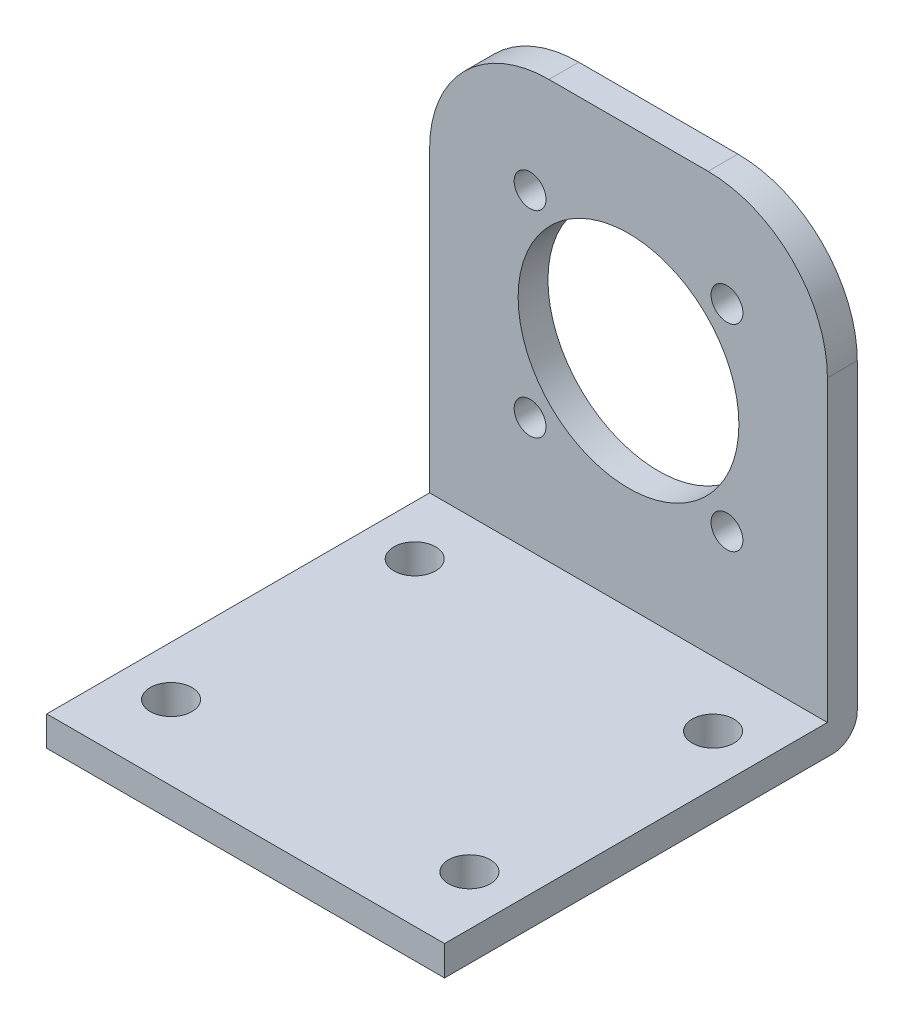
ISO-10303-21;
HEADER;
FILE_DESCRIPTION(('STEP AP214'),'2;1');
FILE_NAME('part.step','',(''),(''),'','','');
FILE_SCHEMA(('AUTOMOTIVE_DESIGN { 1 0 10303 214 1 1 1 1 }'));
ENDSEC;
DATA;
#1=APPLICATION_CONTEXT('core data for automotive mechanical design processes');
#2=APPLICATION_PROTOCOL_DEFINITION('international standard','automotive_design',2000,#1);
#3=PRODUCT_CONTEXT('',#1,'mechanical');
#4=PRODUCT('Part','Part','',(#3));
#5=PRODUCT_RELATED_PRODUCT_CATEGORY('part','',(#4));
#6=PRODUCT_DEFINITION_FORMATION('','',#4);
#7=PRODUCT_DEFINITION_CONTEXT('part definition',#1,'design');
#8=PRODUCT_DEFINITION('design','',#6,#7);
#9=PRODUCT_DEFINITION_SHAPE('','',#8);
#10=(LENGTH_UNIT() NAMED_UNIT(*) SI_UNIT(.MILLI.,.METRE.));
#11=(NAMED_UNIT(*) PLANE_ANGLE_UNIT() SI_UNIT($,.RADIAN.));
#12=(NAMED_UNIT(*) SI_UNIT($,.STERADIAN.) SOLID_ANGLE_UNIT());
#13=UNCERTAINTY_MEASURE_WITH_UNIT(LENGTH_MEASURE(1.E-05),#10,'distance_accuracy_value','');
#14=(GEOMETRIC_REPRESENTATION_CONTEXT(3) GLOBAL_UNCERTAINTY_ASSIGNED_CONTEXT((#13)) GLOBAL_UNIT_ASSIGNED_CONTEXT((#10,
#11,#12)) REPRESENTATION_CONTEXT('',''));
#15=CARTESIAN_POINT('',(0.,0.,0.));
#16=DIRECTION('',(0.,0.,1.));
#17=DIRECTION('',(1.,0.,0.));
#18=AXIS2_PLACEMENT_3D('',#15,#16,#17);
#19=CARTESIAN_POINT('',(-40.,33.419460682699,-26.1464462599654));
#20=DIRECTION('',(0.,1.,0.));
#21=DIRECTION('',(0.,0.,1.));
#22=AXIS2_PLACEMENT_3D('',#19,#20,#21);
#23=PLANE('',#22);
#24=DIRECTION('',(1.,0.,0.));
#25=VECTOR('',#24,1.);
#26=CARTESIAN_POINT('',(-40.,33.419460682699,-23.1464462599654));
#27=LINE('',#26,#25);
#28=CARTESIAN_POINT('',(-27.9999999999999,33.419460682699,-23.1464462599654));
#29=VERTEX_POINT('',#28);
#30=CARTESIAN_POINT('',(-12.0000000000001,33.419460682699,-23.1464462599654));
#31=VERTEX_POINT('',#30);
#32=EDGE_CURVE('E152',#29,#31,#27,.T.);
#33=ORIENTED_EDGE('',*,*,#32,.T.);
#34=DIRECTION('',(0.,0.,1.));
#35=VECTOR('',#34,1.);
#36=CARTESIAN_POINT('',(-12.0000000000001,33.419460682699,-63.1464462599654));
#37=LINE('',#36,#35);
#38=CARTESIAN_POINT('',(-12.0000000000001,33.419460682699,-26.1464462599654));
#39=VERTEX_POINT('',#38);
#40=EDGE_CURVE('E137',#39,#31,#37,.T.);
#41=ORIENTED_EDGE('',*,*,#40,.F.);
#42=DIRECTION('',(1.,0.,0.));
#43=VECTOR('',#42,1.);
#44=CARTESIAN_POINT('',(-40.,33.419460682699,-26.1464462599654));
#45=LINE('',#44,#43);
#46=CARTESIAN_POINT('',(-27.9999999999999,33.419460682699,-26.1464462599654));
#47=VERTEX_POINT('',#46);
#48=EDGE_CURVE('E173',#47,#39,#45,.T.);
#49=ORIENTED_EDGE('',*,*,#48,.F.);
#50=DIRECTION('',(0.,0.,1.));
#51=VECTOR('',#50,1.);
#52=CARTESIAN_POINT('',(-27.9999999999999,33.419460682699,-63.1464462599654));
#53=LINE('',#52,#51);
#54=EDGE_CURVE('E159',#47,#29,#53,.T.);
#55=ORIENTED_EDGE('',*,*,#54,.T.);
#56=EDGE_LOOP('',(#33,#41,#49,#55));
#57=FACE_BOUND('',#56,.T.);
#58=ADVANCED_FACE('F69',(#57),#23,.T.);
#59=CARTESIAN_POINT('',(-40.,-9.08053931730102,-26.1464462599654));
#60=DIRECTION('',(0.,0.,-1.));
#61=DIRECTION('',(-1.,0.,0.));
#62=AXIS2_PLACEMENT_3D('',#59,#60,#61);
#63=PLANE('',#62);
#64=CARTESIAN_POINT('',(-29.8994949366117,22.8189556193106,-26.1464462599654));
#65=DIRECTION('',(0.,0.,-1.));
#66=DIRECTION('',(-1.,0.,0.));
#67=AXIS2_PLACEMENT_3D('',#64,#65,#66);
#68=CIRCLE('',#67,1.6);
#69=CARTESIAN_POINT('',(-31.4994949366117,22.8189556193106,-26.1464462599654));
#70=VERTEX_POINT('',#69);
#71=EDGE_CURVE('E216',#70,#70,#68,.T.);
#72=ORIENTED_EDGE('',*,*,#71,.F.);
#73=EDGE_LOOP('',(#72));
#74=FACE_BOUND('',#73,.T.);
#75=CARTESIAN_POINT('',(-10.1005050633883,22.8189556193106,-26.1464462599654));
#76=DIRECTION('',(0.,0.,-1.));
#77=DIRECTION('',(-1.,0.,0.));
#78=AXIS2_PLACEMENT_3D('',#75,#76,#77);
#79=CIRCLE('',#78,1.6);
#80=CARTESIAN_POINT('',(-11.7005050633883,22.8189556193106,-26.1464462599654));
#81=VERTEX_POINT('',#80);
#82=EDGE_CURVE('E291',#81,#81,#79,.T.);
#83=ORIENTED_EDGE('',*,*,#82,.F.);
#84=EDGE_LOOP('',(#83));
#85=FACE_BOUND('',#84,.T.);
#86=CARTESIAN_POINT('',(-10.1005050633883,3.01996574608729,-26.1464462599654));
#87=DIRECTION('',(0.,0.,-1.));
#88=DIRECTION('',(-1.,0.,0.));
#89=AXIS2_PLACEMENT_3D('',#86,#87,#88);
#90=CIRCLE('',#89,1.6);
#91=CARTESIAN_POINT('',(-11.7005050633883,3.01996574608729,-26.1464462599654));
#92=VERTEX_POINT('',#91);
#93=EDGE_CURVE('E288',#92,#92,#90,.T.);
#94=ORIENTED_EDGE('',*,*,#93,.F.);
#95=EDGE_LOOP('',(#94));
#96=FACE_BOUND('',#95,.T.);
#97=CARTESIAN_POINT('',(-29.8994949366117,3.01996574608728,-26.1464462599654));
#98=DIRECTION('',(0.,0.,-1.));
#99=DIRECTION('',(-1.,0.,0.));
#100=AXIS2_PLACEMENT_3D('',#97,#98,#99);
#101=CIRCLE('',#100,1.6);
#102=CARTESIAN_POINT('',(-31.4994949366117,3.01996574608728,-26.1464462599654));
#103=VERTEX_POINT('',#102);
#104=EDGE_CURVE('E284',#103,#103,#101,.T.);
#105=ORIENTED_EDGE('',*,*,#104,.F.);
#106=EDGE_LOOP('',(#105));
#107=FACE_BOUND('',#106,.T.);
#108=CARTESIAN_POINT('',(-20.,12.919460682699,-26.1464462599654));
#109=DIRECTION('',(0.,0.,-1.));
#110=DIRECTION('',(-1.,0.,0.));
#111=AXIS2_PLACEMENT_3D('',#108,#109,#110);
#112=CIRCLE('',#111,11.1);
#113=CARTESIAN_POINT('',(-31.1,12.919460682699,-26.1464462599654));
#114=VERTEX_POINT('',#113);
#115=EDGE_CURVE('E280',#114,#114,#112,.T.);
#116=ORIENTED_EDGE('',*,*,#115,.F.);
#117=EDGE_LOOP('',(#116));
#118=FACE_BOUND('',#117,.T.);
#119=CARTESIAN_POINT('',(-12.,21.419460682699,-26.1464462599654));
#120=DIRECTION('',(0.,0.,-1.));
#121=DIRECTION('',(-1.,0.,0.));
#122=AXIS2_PLACEMENT_3D('',#119,#120,#121);
#123=CIRCLE('',#122,12.);
#124=CARTESIAN_POINT('',(0.,21.4194606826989,-26.1464462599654));
#125=VERTEX_POINT('',#124);
#126=EDGE_CURVE('E140',#125,#39,#123,.F.);
#127=ORIENTED_EDGE('',*,*,#126,.F.);
#128=DIRECTION('',(0.,1.,0.));
#129=VECTOR('',#128,1.);
#130=CARTESIAN_POINT('',(0.,-9.08053931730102,-26.1464462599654));
#131=LINE('',#130,#129);
#132=CARTESIAN_POINT('',(0.,-9.08053931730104,-26.1464462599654));
#133=VERTEX_POINT('',#132);
#134=EDGE_CURVE('E182',#133,#125,#131,.T.);
#135=ORIENTED_EDGE('',*,*,#134,.F.);
#136=DIRECTION('',(1.,0.,0.));
#137=VECTOR('',#136,1.);
#138=CARTESIAN_POINT('',(-40.,-9.08053931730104,-26.1464462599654));
#139=LINE('',#138,#137);
#140=CARTESIAN_POINT('',(-40.,-9.08053931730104,-26.1464462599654));
#141=VERTEX_POINT('',#140);
#142=EDGE_CURVE('E175',#141,#133,#139,.T.);
#143=ORIENTED_EDGE('',*,*,#142,.F.);
#144=DIRECTION('',(0.,1.,0.));
#145=VECTOR('',#144,1.);
#146=CARTESIAN_POINT('',(-40.,-9.08053931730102,-26.1464462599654));
#147=LINE('',#146,#145);
#148=CARTESIAN_POINT('',(-40.,21.4194606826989,-26.1464462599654));
#149=VERTEX_POINT('',#148);
#150=EDGE_CURVE('E162',#141,#149,#147,.T.);
#151=ORIENTED_EDGE('',*,*,#150,.T.);
#152=CARTESIAN_POINT('',(-28.,21.419460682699,-26.1464462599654));
#153=DIRECTION('',(0.,0.,-1.));
#154=DIRECTION('',(-1.,0.,0.));
#155=AXIS2_PLACEMENT_3D('',#152,#153,#154);
#156=CIRCLE('',#155,12.);
#157=EDGE_CURVE('E84',#47,#149,#156,.F.);
#158=ORIENTED_EDGE('',*,*,#157,.F.);
#159=ORIENTED_EDGE('',*,*,#48,.T.);
#160=EDGE_LOOP('',(#127,#135,#143,#151,#158,#159));
#161=FACE_BOUND('',#160,.T.);
#162=ADVANCED_FACE('F252',(#74,#85,#96,#107,#118,#161),#63,.T.);
#163=CARTESIAN_POINT('',(-40.,33.419460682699,-23.1464462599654));
#164=DIRECTION('',(0.,0.,1.));
#165=DIRECTION('',(0.,-1.,0.));
#166=AXIS2_PLACEMENT_3D('',#163,#164,#165);
#167=PLANE('',#166);
#168=CARTESIAN_POINT('',(-29.8994949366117,22.8189556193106,-23.1464462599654));
#169=DIRECTION('',(0.,0.,1.));
#170=DIRECTION('',(1.,0.,0.));
#171=AXIS2_PLACEMENT_3D('',#168,#169,#170);
#172=CIRCLE('',#171,1.6);
#173=CARTESIAN_POINT('',(-28.2994949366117,22.8189556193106,-23.1464462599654));
#174=VERTEX_POINT('',#173);
#175=EDGE_CURVE('E256',#174,#174,#172,.T.);
#176=ORIENTED_EDGE('',*,*,#175,.F.);
#177=EDGE_LOOP('',(#176));
#178=FACE_BOUND('',#177,.T.);
#179=CARTESIAN_POINT('',(-10.1005050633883,22.8189556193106,-23.1464462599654));
#180=DIRECTION('',(0.,0.,1.));
#181=DIRECTION('',(1.,0.,0.));
#182=AXIS2_PLACEMENT_3D('',#179,#180,#181);
#183=CIRCLE('',#182,1.6);
#184=CARTESIAN_POINT('',(-8.50050506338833,22.8189556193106,-23.1464462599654));
#185=VERTEX_POINT('',#184);
#186=EDGE_CURVE('E270',#185,#185,#183,.T.);
#187=ORIENTED_EDGE('',*,*,#186,.F.);
#188=EDGE_LOOP('',(#187));
#189=FACE_BOUND('',#188,.T.);
#190=CARTESIAN_POINT('',(-10.1005050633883,3.01996574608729,-23.1464462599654));
#191=DIRECTION('',(0.,0.,1.));
#192=DIRECTION('',(1.,0.,0.));
#193=AXIS2_PLACEMENT_3D('',#190,#191,#192);
#194=CIRCLE('',#193,1.6);
#195=CARTESIAN_POINT('',(-8.50050506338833,3.01996574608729,-23.1464462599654));
#196=VERTEX_POINT('',#195);
#197=EDGE_CURVE('E266',#196,#196,#194,.T.);
#198=ORIENTED_EDGE('',*,*,#197,.F.);
#199=EDGE_LOOP('',(#198));
#200=FACE_BOUND('',#199,.T.);
#201=CARTESIAN_POINT('',(-29.8994949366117,3.01996574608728,-23.1464462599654));
#202=DIRECTION('',(0.,0.,1.));
#203=DIRECTION('',(1.,0.,0.));
#204=AXIS2_PLACEMENT_3D('',#201,#202,#203);
#205=CIRCLE('',#204,1.6);
#206=CARTESIAN_POINT('',(-28.2994949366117,3.01996574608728,-23.1464462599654));
#207=VERTEX_POINT('',#206);
#208=EDGE_CURVE('E261',#207,#207,#205,.T.);
#209=ORIENTED_EDGE('',*,*,#208,.F.);
#210=EDGE_LOOP('',(#209));
#211=FACE_BOUND('',#210,.T.);
#212=CARTESIAN_POINT('',(-20.,12.919460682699,-23.1464462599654));
#213=DIRECTION('',(0.,0.,1.));
#214=DIRECTION('',(1.,0.,0.));
#215=AXIS2_PLACEMENT_3D('',#212,#213,#214);
#216=CIRCLE('',#215,11.1);
#217=CARTESIAN_POINT('',(-8.9,12.919460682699,-23.1464462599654));
#218=VERTEX_POINT('',#217);
#219=EDGE_CURVE('E265',#218,#218,#216,.T.);
#220=ORIENTED_EDGE('',*,*,#219,.F.);
#221=EDGE_LOOP('',(#220));
#222=FACE_BOUND('',#221,.T.);
#223=CARTESIAN_POINT('',(-12.,21.419460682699,-23.1464462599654));
#224=DIRECTION('',(0.,0.,-1.));
#225=DIRECTION('',(-1.,0.,0.));
#226=AXIS2_PLACEMENT_3D('',#223,#224,#225);
#227=CIRCLE('',#226,12.);
#228=CARTESIAN_POINT('',(0.,21.4194606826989,-23.1464462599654));
#229=VERTEX_POINT('',#228);
#230=EDGE_CURVE('E91',#31,#229,#227,.T.);
#231=ORIENTED_EDGE('',*,*,#230,.F.);
#232=ORIENTED_EDGE('',*,*,#32,.F.);
#233=CARTESIAN_POINT('',(-28.,21.419460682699,-23.1464462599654));
#234=DIRECTION('',(0.,0.,-1.));
#235=DIRECTION('',(1.,0.,0.));
#236=AXIS2_PLACEMENT_3D('',#233,#234,#235);
#237=CIRCLE('',#236,12.);
#238=CARTESIAN_POINT('',(-40.,21.4194606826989,-23.1464462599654));
#239=VERTEX_POINT('',#238);
#240=EDGE_CURVE('E156',#239,#29,#237,.T.);
#241=ORIENTED_EDGE('',*,*,#240,.F.);
#242=DIRECTION('',(0.,-1.,0.));
#243=VECTOR('',#242,1.);
#244=CARTESIAN_POINT('',(-40.,33.419460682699,-23.1464462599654));
#245=LINE('',#244,#243);
#246=CARTESIAN_POINT('',(-40.,-8.58053931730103,-23.1464462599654));
#247=VERTEX_POINT('',#246);
#248=EDGE_CURVE('E227',#239,#247,#245,.T.);
#249=ORIENTED_EDGE('',*,*,#248,.T.);
#250=DIRECTION('',(1.,0.,0.));
#251=VECTOR('',#250,1.);
#252=CARTESIAN_POINT('',(-40.,-8.58053931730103,-23.1464462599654));
#253=LINE('',#252,#251);
#254=CARTESIAN_POINT('',(0.,-8.58053931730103,-23.1464462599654));
#255=VERTEX_POINT('',#254);
#256=EDGE_CURVE('E161',#247,#255,#253,.T.);
#257=ORIENTED_EDGE('',*,*,#256,.T.);
#258=DIRECTION('',(0.,-1.,0.));
#259=VECTOR('',#258,1.);
#260=CARTESIAN_POINT('',(0.,33.419460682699,-23.1464462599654));
#261=LINE('',#260,#259);
#262=EDGE_CURVE('E154',#229,#255,#261,.T.);
#263=ORIENTED_EDGE('',*,*,#262,.F.);
#264=EDGE_LOOP('',(#231,#232,#241,#249,#257,#263));
#265=FACE_BOUND('',#264,.T.);
#266=ADVANCED_FACE('F150',(#178,#189,#200,#211,#222,#265),#167,.T.);
#267=CARTESIAN_POINT('',(-40.,-9.08053931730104,-23.6464462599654));
#268=DIRECTION('',(1.,0.,0.));
#269=DIRECTION('',(0.,0.,-1.));
#270=AXIS2_PLACEMENT_3D('',#267,#268,#269);
#271=CYLINDRICAL_SURFACE('',#270,2.5);
#272=CARTESIAN_POINT('',(0.,-9.08053931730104,-23.6464462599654));
#273=DIRECTION('',(1.,0.,0.));
#274=DIRECTION('',(0.,0.,-1.));
#275=AXIS2_PLACEMENT_3D('',#272,#273,#274);
#276=CIRCLE('',#275,2.5);
#277=CARTESIAN_POINT('',(0.,-11.580539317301,-23.6464462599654));
#278=VERTEX_POINT('',#277);
#279=EDGE_CURVE('E220',#278,#133,#276,.T.);
#280=ORIENTED_EDGE('',*,*,#279,.F.);
#281=DIRECTION('',(1.,0.,0.));
#282=VECTOR('',#281,1.);
#283=CARTESIAN_POINT('',(-40.,-11.580539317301,-23.6464462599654));
#284=LINE('',#283,#282);
#285=CARTESIAN_POINT('',(-40.,-11.580539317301,-23.6464462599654));
#286=VERTEX_POINT('',#285);
#287=EDGE_CURVE('E179',#286,#278,#284,.T.);
#288=ORIENTED_EDGE('',*,*,#287,.F.);
#289=CARTESIAN_POINT('',(-40.,-9.08053931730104,-23.6464462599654));
#290=DIRECTION('',(1.,0.,0.));
#291=DIRECTION('',(0.,0.,-1.));
#292=AXIS2_PLACEMENT_3D('',#289,#290,#291);
#293=CIRCLE('',#292,2.5);
#294=EDGE_CURVE('E169',#286,#141,#293,.T.);
#295=ORIENTED_EDGE('',*,*,#294,.T.);
#296=ORIENTED_EDGE('',*,*,#142,.T.);
#297=EDGE_LOOP('',(#280,#288,#295,#296));
#298=FACE_BOUND('',#297,.T.);
#299=ADVANCED_FACE('F248',(#298),#271,.T.);
#300=CARTESIAN_POINT('',(-40.,-11.580539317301,15.3535537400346));
#301=DIRECTION('',(0.,-1.,0.));
#302=DIRECTION('',(0.,0.,-1.));
#303=AXIS2_PLACEMENT_3D('',#300,#301,#302);
#304=PLANE('',#303);
#305=CARTESIAN_POINT('',(-35.,-11.580539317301,-16.6464462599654));
#306=DIRECTION('',(0.,-1.,0.));
#307=DIRECTION('',(0.,0.,-1.));
#308=AXIS2_PLACEMENT_3D('',#305,#306,#307);
#309=CIRCLE('',#308,2.1);
#310=CARTESIAN_POINT('',(-35.,-11.580539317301,-18.7464462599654));
#311=VERTEX_POINT('',#310);
#312=EDGE_CURVE('E466',#311,#311,#309,.T.);
#313=ORIENTED_EDGE('',*,*,#312,.F.);
#314=EDGE_LOOP('',(#313));
#315=FACE_BOUND('',#314,.T.);
#316=CARTESIAN_POINT('',(-5.,-11.580539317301,7.85355374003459));
#317=DIRECTION('',(0.,-1.,0.));
#318=DIRECTION('',(0.,0.,-1.));
#319=AXIS2_PLACEMENT_3D('',#316,#317,#318);
#320=CIRCLE('',#319,2.1);
#321=CARTESIAN_POINT('',(-5.,-11.580539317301,5.75355374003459));
#322=VERTEX_POINT('',#321);
#323=EDGE_CURVE('E462',#322,#322,#320,.T.);
#324=ORIENTED_EDGE('',*,*,#323,.F.);
#325=EDGE_LOOP('',(#324));
#326=FACE_BOUND('',#325,.T.);
#327=CARTESIAN_POINT('',(-5.,-11.580539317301,-16.6464462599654));
#328=DIRECTION('',(0.,-1.,0.));
#329=DIRECTION('',(0.,0.,-1.));
#330=AXIS2_PLACEMENT_3D('',#327,#328,#329);
#331=CIRCLE('',#330,2.1);
#332=CARTESIAN_POINT('',(-5.,-11.580539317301,-18.7464462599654));
#333=VERTEX_POINT('',#332);
#334=EDGE_CURVE('E454',#333,#333,#331,.T.);
#335=ORIENTED_EDGE('',*,*,#334,.F.);
#336=EDGE_LOOP('',(#335));
#337=FACE_BOUND('',#336,.T.);
#338=CARTESIAN_POINT('',(-35.,-11.580539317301,7.8535537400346));
#339=DIRECTION('',(0.,-1.,0.));
#340=DIRECTION('',(0.,0.,-1.));
#341=AXIS2_PLACEMENT_3D('',#338,#339,#340);
#342=CIRCLE('',#341,2.1);
#343=CARTESIAN_POINT('',(-35.,-11.580539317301,5.7535537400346));
#344=VERTEX_POINT('',#343);
#345=EDGE_CURVE('E449',#344,#344,#342,.T.);
#346=ORIENTED_EDGE('',*,*,#345,.F.);
#347=EDGE_LOOP('',(#346));
#348=FACE_BOUND('',#347,.T.);
#349=DIRECTION('',(0.,0.,-1.));
#350=VECTOR('',#349,1.);
#351=CARTESIAN_POINT('',(0.,-11.580539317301,15.3535537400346));
#352=LINE('',#351,#350);
#353=CARTESIAN_POINT('',(0.,-11.580539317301,15.3535537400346));
#354=VERTEX_POINT('',#353);
#355=EDGE_CURVE('E210',#354,#278,#352,.T.);
#356=ORIENTED_EDGE('',*,*,#355,.F.);
#357=DIRECTION('',(1.,0.,0.));
#358=VECTOR('',#357,1.);
#359=CARTESIAN_POINT('',(-40.,-11.580539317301,15.3535537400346));
#360=LINE('',#359,#358);
#361=CARTESIAN_POINT('',(-40.,-11.580539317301,15.3535537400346));
#362=VERTEX_POINT('',#361);
#363=EDGE_CURVE('E187',#362,#354,#360,.T.);
#364=ORIENTED_EDGE('',*,*,#363,.F.);
#365=DIRECTION('',(0.,0.,-1.));
#366=VECTOR('',#365,1.);
#367=CARTESIAN_POINT('',(-40.,-11.580539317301,15.3535537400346));
#368=LINE('',#367,#366);
#369=EDGE_CURVE('E239',#362,#286,#368,.T.);
#370=ORIENTED_EDGE('',*,*,#369,.T.);
#371=ORIENTED_EDGE('',*,*,#287,.T.);
#372=EDGE_LOOP('',(#356,#364,#370,#371));
#373=FACE_BOUND('',#372,.T.);
#374=ADVANCED_FACE('F326',(#315,#326,#337,#348,#373),#304,.T.);
#375=CARTESIAN_POINT('',(-40.,-8.58053931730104,15.3535537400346));
#376=DIRECTION('',(0.,0.,1.));
#377=DIRECTION('',(0.,-1.,0.));
#378=AXIS2_PLACEMENT_3D('',#375,#376,#377);
#379=PLANE('',#378);
#380=DIRECTION('',(0.,-1.,0.));
#381=VECTOR('',#380,1.);
#382=CARTESIAN_POINT('',(0.,-8.58053931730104,15.3535537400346));
#383=LINE('',#382,#381);
#384=CARTESIAN_POINT('',(0.,-8.58053931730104,15.3535537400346));
#385=VERTEX_POINT('',#384);
#386=EDGE_CURVE('E204',#385,#354,#383,.T.);
#387=ORIENTED_EDGE('',*,*,#386,.F.);
#388=DIRECTION('',(1.,0.,0.));
#389=VECTOR('',#388,1.);
#390=CARTESIAN_POINT('',(-40.,-8.58053931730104,15.3535537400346));
#391=LINE('',#390,#389);
#392=CARTESIAN_POINT('',(-40.,-8.58053931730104,15.3535537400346));
#393=VERTEX_POINT('',#392);
#394=EDGE_CURVE('E166',#393,#385,#391,.T.);
#395=ORIENTED_EDGE('',*,*,#394,.F.);
#396=DIRECTION('',(0.,-1.,0.));
#397=VECTOR('',#396,1.);
#398=CARTESIAN_POINT('',(-40.,-8.58053931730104,15.3535537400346));
#399=LINE('',#398,#397);
#400=EDGE_CURVE('E232',#393,#362,#399,.T.);
#401=ORIENTED_EDGE('',*,*,#400,.T.);
#402=ORIENTED_EDGE('',*,*,#363,.T.);
#403=EDGE_LOOP('',(#387,#395,#401,#402));
#404=FACE_BOUND('',#403,.T.);
#405=ADVANCED_FACE('F205',(#404),#379,.T.);
#406=CARTESIAN_POINT('',(-40.,-8.58053931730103,-23.1464462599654));
#407=DIRECTION('',(0.,1.,0.));
#408=DIRECTION('',(0.,0.,1.));
#409=AXIS2_PLACEMENT_3D('',#406,#407,#408);
#410=PLANE('',#409);
#411=CARTESIAN_POINT('',(-35.,-8.58053931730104,-16.6464462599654));
#412=DIRECTION('',(0.,1.,0.));
#413=DIRECTION('',(0.,0.,1.));
#414=AXIS2_PLACEMENT_3D('',#411,#412,#413);
#415=CIRCLE('',#414,2.1);
#416=CARTESIAN_POINT('',(-35.,-8.58053931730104,-14.5464462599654));
#417=VERTEX_POINT('',#416);
#418=EDGE_CURVE('E435',#417,#417,#415,.T.);
#419=ORIENTED_EDGE('',*,*,#418,.F.);
#420=EDGE_LOOP('',(#419));
#421=FACE_BOUND('',#420,.T.);
#422=CARTESIAN_POINT('',(-5.,-8.58053931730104,7.85355374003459));
#423=DIRECTION('',(0.,1.,0.));
#424=DIRECTION('',(0.,0.,1.));
#425=AXIS2_PLACEMENT_3D('',#422,#423,#424);
#426=CIRCLE('',#425,2.1);
#427=CARTESIAN_POINT('',(-5.,-8.58053931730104,9.95355374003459));
#428=VERTEX_POINT('',#427);
#429=EDGE_CURVE('E439',#428,#428,#426,.T.);
#430=ORIENTED_EDGE('',*,*,#429,.F.);
#431=EDGE_LOOP('',(#430));
#432=FACE_BOUND('',#431,.T.);
#433=CARTESIAN_POINT('',(-5.,-8.58053931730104,-16.6464462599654));
#434=DIRECTION('',(0.,1.,0.));
#435=DIRECTION('',(0.,0.,1.));
#436=AXIS2_PLACEMENT_3D('',#433,#434,#435);
#437=CIRCLE('',#436,2.1);
#438=CARTESIAN_POINT('',(-5.,-8.58053931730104,-14.5464462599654));
#439=VERTEX_POINT('',#438);
#440=EDGE_CURVE('E443',#439,#439,#437,.T.);
#441=ORIENTED_EDGE('',*,*,#440,.F.);
#442=EDGE_LOOP('',(#441));
#443=FACE_BOUND('',#442,.T.);
#444=CARTESIAN_POINT('',(-35.,-8.58053931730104,7.8535537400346));
#445=DIRECTION('',(0.,1.,0.));
#446=DIRECTION('',(0.,0.,1.));
#447=AXIS2_PLACEMENT_3D('',#444,#445,#446);
#448=CIRCLE('',#447,2.1);
#449=CARTESIAN_POINT('',(-35.,-8.58053931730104,9.95355374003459));
#450=VERTEX_POINT('',#449);
#451=EDGE_CURVE('E446',#450,#450,#448,.T.);
#452=ORIENTED_EDGE('',*,*,#451,.F.);
#453=EDGE_LOOP('',(#452));
#454=FACE_BOUND('',#453,.T.);
#455=DIRECTION('',(0.,0.,1.));
#456=VECTOR('',#455,1.);
#457=CARTESIAN_POINT('',(0.,-8.58053931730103,-23.1464462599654));
#458=LINE('',#457,#456);
#459=EDGE_CURVE('E197',#255,#385,#458,.T.);
#460=ORIENTED_EDGE('',*,*,#459,.F.);
#461=ORIENTED_EDGE('',*,*,#256,.F.);
#462=DIRECTION('',(0.,0.,1.));
#463=VECTOR('',#462,1.);
#464=CARTESIAN_POINT('',(-40.,-8.58053931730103,-23.1464462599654));
#465=LINE('',#464,#463);
#466=EDGE_CURVE('E199',#247,#393,#465,.T.);
#467=ORIENTED_EDGE('',*,*,#466,.T.);
#468=ORIENTED_EDGE('',*,*,#394,.T.);
#469=EDGE_LOOP('',(#460,#461,#467,#468));
#470=FACE_BOUND('',#469,.T.);
#471=ADVANCED_FACE('F194',(#421,#432,#443,#454,#470),#410,.T.);
#472=CARTESIAN_POINT('',(-40.,-9.08053931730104,-23.6464462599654));
#473=DIRECTION('',(1.,0.,0.));
#474=DIRECTION('',(0.,0.,-1.));
#475=AXIS2_PLACEMENT_3D('',#472,#473,#474);
#476=PLANE('',#475);
#477=ORIENTED_EDGE('',*,*,#248,.F.);
#478=DIRECTION('',(0.,0.,1.));
#479=VECTOR('',#478,1.);
#480=CARTESIAN_POINT('',(-40.,21.419460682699,-63.1464462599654));
#481=LINE('',#480,#479);
#482=EDGE_CURVE('E12',#239,#149,#481,.F.);
#483=ORIENTED_EDGE('',*,*,#482,.T.);
#484=ORIENTED_EDGE('',*,*,#150,.F.);
#485=ORIENTED_EDGE('',*,*,#294,.F.);
#486=ORIENTED_EDGE('',*,*,#369,.F.);
#487=ORIENTED_EDGE('',*,*,#400,.F.);
#488=ORIENTED_EDGE('',*,*,#466,.F.);
#489=EDGE_LOOP('',(#477,#483,#484,#485,#486,#487,#488));
#490=FACE_BOUND('',#489,.T.);
#491=ADVANCED_FACE('F251',(#490),#476,.F.);
#492=CARTESIAN_POINT('',(0.,-9.08053931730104,-23.6464462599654));
#493=DIRECTION('',(1.,0.,0.));
#494=DIRECTION('',(0.,0.,-1.));
#495=AXIS2_PLACEMENT_3D('',#492,#493,#494);
#496=PLANE('',#495);
#497=DIRECTION('',(0.,0.,1.));
#498=VECTOR('',#497,1.);
#499=CARTESIAN_POINT('',(0.,21.419460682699,-63.1464462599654));
#500=LINE('',#499,#498);
#501=EDGE_CURVE('E77',#229,#125,#500,.F.);
#502=ORIENTED_EDGE('',*,*,#501,.F.);
#503=ORIENTED_EDGE('',*,*,#262,.T.);
#504=ORIENTED_EDGE('',*,*,#459,.T.);
#505=ORIENTED_EDGE('',*,*,#386,.T.);
#506=ORIENTED_EDGE('',*,*,#355,.T.);
#507=ORIENTED_EDGE('',*,*,#279,.T.);
#508=ORIENTED_EDGE('',*,*,#134,.T.);
#509=EDGE_LOOP('',(#502,#503,#504,#505,#506,#507,#508));
#510=FACE_BOUND('',#509,.T.);
#511=ADVANCED_FACE('F212',(#510),#496,.T.);
#512=CARTESIAN_POINT('',(-20.,12.919460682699,-63.1464462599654));
#513=DIRECTION('',(0.,0.,1.));
#514=DIRECTION('',(1.,0.,0.));
#515=AXIS2_PLACEMENT_3D('',#512,#513,#514);
#516=CYLINDRICAL_SURFACE('',#515,11.1);
#517=ORIENTED_EDGE('',*,*,#115,.T.);
#518=EDGE_LOOP('',(#517));
#519=FACE_BOUND('',#518,.T.);
#520=ORIENTED_EDGE('',*,*,#219,.T.);
#521=EDGE_LOOP('',(#520));
#522=FACE_BOUND('',#521,.T.);
#523=ADVANCED_FACE('F313',(#519,#522),#516,.F.);
#524=CARTESIAN_POINT('',(-29.8994949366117,3.01996574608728,-63.1464462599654));
#525=DIRECTION('',(0.,0.,1.));
#526=DIRECTION('',(1.,0.,0.));
#527=AXIS2_PLACEMENT_3D('',#524,#525,#526);
#528=CYLINDRICAL_SURFACE('',#527,1.6);
#529=ORIENTED_EDGE('',*,*,#104,.T.);
#530=EDGE_LOOP('',(#529));
#531=FACE_BOUND('',#530,.T.);
#532=ORIENTED_EDGE('',*,*,#208,.T.);
#533=EDGE_LOOP('',(#532));
#534=FACE_BOUND('',#533,.T.);
#535=ADVANCED_FACE('F316',(#531,#534),#528,.F.);
#536=CARTESIAN_POINT('',(-10.1005050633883,3.01996574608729,-63.1464462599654));
#537=DIRECTION('',(0.,0.,1.));
#538=DIRECTION('',(1.,0.,0.));
#539=AXIS2_PLACEMENT_3D('',#536,#537,#538);
#540=CYLINDRICAL_SURFACE('',#539,1.6);
#541=ORIENTED_EDGE('',*,*,#93,.T.);
#542=EDGE_LOOP('',(#541));
#543=FACE_BOUND('',#542,.T.);
#544=ORIENTED_EDGE('',*,*,#197,.T.);
#545=EDGE_LOOP('',(#544));
#546=FACE_BOUND('',#545,.T.);
#547=ADVANCED_FACE('F416',(#543,#546),#540,.F.);
#548=CARTESIAN_POINT('',(-10.1005050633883,22.8189556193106,-63.1464462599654));
#549=DIRECTION('',(0.,0.,1.));
#550=DIRECTION('',(1.,0.,0.));
#551=AXIS2_PLACEMENT_3D('',#548,#549,#550);
#552=CYLINDRICAL_SURFACE('',#551,1.6);
#553=ORIENTED_EDGE('',*,*,#82,.T.);
#554=EDGE_LOOP('',(#553));
#555=FACE_BOUND('',#554,.T.);
#556=ORIENTED_EDGE('',*,*,#186,.T.);
#557=EDGE_LOOP('',(#556));
#558=FACE_BOUND('',#557,.T.);
#559=ADVANCED_FACE('F420',(#555,#558),#552,.F.);
#560=CARTESIAN_POINT('',(-29.8994949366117,22.8189556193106,-63.1464462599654));
#561=DIRECTION('',(0.,0.,1.));
#562=DIRECTION('',(1.,0.,0.));
#563=AXIS2_PLACEMENT_3D('',#560,#561,#562);
#564=CYLINDRICAL_SURFACE('',#563,1.6);
#565=ORIENTED_EDGE('',*,*,#71,.T.);
#566=EDGE_LOOP('',(#565));
#567=FACE_BOUND('',#566,.T.);
#568=ORIENTED_EDGE('',*,*,#175,.T.);
#569=EDGE_LOOP('',(#568));
#570=FACE_BOUND('',#569,.T.);
#571=ADVANCED_FACE('F300',(#567,#570),#564,.F.);
#572=CARTESIAN_POINT('',(-12.,21.419460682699,-63.1464462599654));
#573=DIRECTION('',(0.,0.,1.));
#574=DIRECTION('',(1.,0.,0.));
#575=AXIS2_PLACEMENT_3D('',#572,#573,#574);
#576=CYLINDRICAL_SURFACE('',#575,12.);
#577=ORIENTED_EDGE('',*,*,#126,.T.);
#578=ORIENTED_EDGE('',*,*,#40,.T.);
#579=ORIENTED_EDGE('',*,*,#230,.T.);
#580=ORIENTED_EDGE('',*,*,#501,.T.);
#581=EDGE_LOOP('',(#577,#578,#579,#580));
#582=FACE_BOUND('',#581,.T.);
#583=ADVANCED_FACE('F138',(#582),#576,.T.);
#584=CARTESIAN_POINT('',(-28.,21.419460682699,-63.1464462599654));
#585=DIRECTION('',(0.,0.,1.));
#586=DIRECTION('',(1.,0.,0.));
#587=AXIS2_PLACEMENT_3D('',#584,#585,#586);
#588=CYLINDRICAL_SURFACE('',#587,12.);
#589=ORIENTED_EDGE('',*,*,#157,.T.);
#590=ORIENTED_EDGE('',*,*,#482,.F.);
#591=ORIENTED_EDGE('',*,*,#240,.T.);
#592=ORIENTED_EDGE('',*,*,#54,.F.);
#593=EDGE_LOOP('',(#589,#590,#591,#592));
#594=FACE_BOUND('',#593,.T.);
#595=ADVANCED_FACE('F357',(#594),#588,.T.);
#596=CARTESIAN_POINT('',(-35.,-48.580539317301,7.85355374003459));
#597=DIRECTION('',(0.,1.,0.));
#598=DIRECTION('',(0.,0.,1.));
#599=AXIS2_PLACEMENT_3D('',#596,#597,#598);
#600=CYLINDRICAL_SURFACE('',#599,2.1);
#601=ORIENTED_EDGE('',*,*,#345,.T.);
#602=EDGE_LOOP('',(#601));
#603=FACE_BOUND('',#602,.T.);
#604=ORIENTED_EDGE('',*,*,#451,.T.);
#605=EDGE_LOOP('',(#604));
#606=FACE_BOUND('',#605,.T.);
#607=ADVANCED_FACE('F367',(#603,#606),#600,.F.);
#608=CARTESIAN_POINT('',(-5.,-48.580539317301,-16.6464462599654));
#609=DIRECTION('',(0.,1.,0.));
#610=DIRECTION('',(0.,0.,1.));
#611=AXIS2_PLACEMENT_3D('',#608,#609,#610);
#612=CYLINDRICAL_SURFACE('',#611,2.1);
#613=ORIENTED_EDGE('',*,*,#334,.T.);
#614=EDGE_LOOP('',(#613));
#615=FACE_BOUND('',#614,.T.);
#616=ORIENTED_EDGE('',*,*,#440,.T.);
#617=EDGE_LOOP('',(#616));
#618=FACE_BOUND('',#617,.T.);
#619=ADVANCED_FACE('F377',(#615,#618),#612,.F.);
#620=CARTESIAN_POINT('',(-5.,-48.580539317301,7.85355374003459));
#621=DIRECTION('',(0.,1.,0.));
#622=DIRECTION('',(0.,0.,1.));
#623=AXIS2_PLACEMENT_3D('',#620,#621,#622);
#624=CYLINDRICAL_SURFACE('',#623,2.1);
#625=ORIENTED_EDGE('',*,*,#323,.T.);
#626=EDGE_LOOP('',(#625));
#627=FACE_BOUND('',#626,.T.);
#628=ORIENTED_EDGE('',*,*,#429,.T.);
#629=EDGE_LOOP('',(#628));
#630=FACE_BOUND('',#629,.T.);
#631=ADVANCED_FACE('F388',(#627,#630),#624,.F.);
#632=CARTESIAN_POINT('',(-35.,-48.580539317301,-16.6464462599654));
#633=DIRECTION('',(0.,1.,0.));
#634=DIRECTION('',(0.,0.,1.));
#635=AXIS2_PLACEMENT_3D('',#632,#633,#634);
#636=CYLINDRICAL_SURFACE('',#635,2.1);
#637=ORIENTED_EDGE('',*,*,#312,.T.);
#638=EDGE_LOOP('',(#637));
#639=FACE_BOUND('',#638,.T.);
#640=ORIENTED_EDGE('',*,*,#418,.T.);
#641=EDGE_LOOP('',(#640));
#642=FACE_BOUND('',#641,.T.);
#643=ADVANCED_FACE('F398',(#639,#642),#636,.F.);
#644=CLOSED_SHELL('',(#58,#162,#266,#299,#374,#405,#471,#491,#511,#523,#535,#547,#559,#571,#583,
#595,#607,#619,#631,#643));
#645=MANIFOLD_SOLID_BREP('B2',#644);
#646=ADVANCED_BREP_SHAPE_REPRESENTATION('',(#18,#645),#14);
#647=SHAPE_DEFINITION_REPRESENTATION(#9,#646);
ENDSEC;
END-ISO-10303-21;
